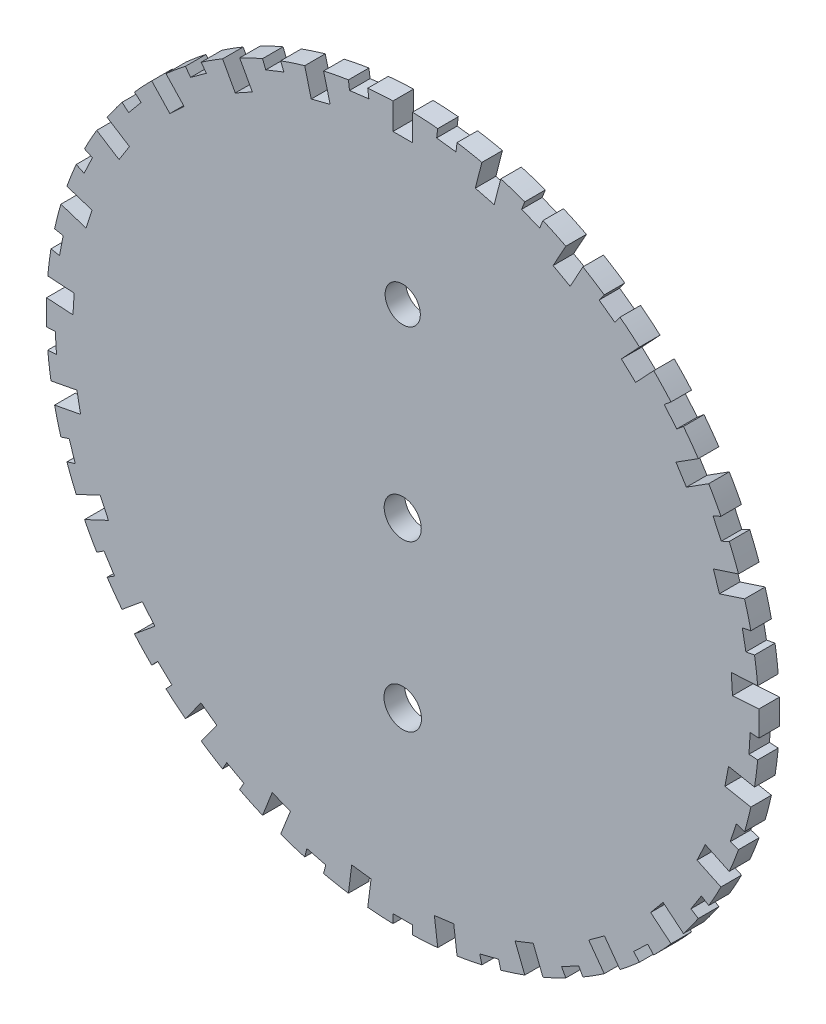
from build123d import *

# Parameters (mm, degrees)
SKETCH1_R           = 2.6873019
SKETCH1_R_2         = 2.658585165
SKETCH1_R_3         = 2.523916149
BOSS_EXTRUDE1_DEPTH = 2.9464


with BuildPart() as part:
    # Sketch1 → Boss-Extrude1 (new body)
    with BuildSketch(Plane.XY):
        with BuildLine():
            Line((13.112954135, 45.454146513), (10.406732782, 46.148986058))
            Line((10.406732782, 46.148986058), (11.349491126, 49.82078738))
            ThreePointArc((11.349491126, 49.82078738), (9.57465676, 50.192108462), (7.787765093, 50.500222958))
            Line((7.787765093, 50.500222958), (7.630985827, 49.259187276))
            Line((7.630985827, 49.259187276), (4.859017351, 49.60936833))
            Line((4.859017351, 49.60936833), (5.015796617, 50.850404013))
            ThreePointArc((5.015796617, 50.850404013), (3.208418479, 50.996351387), (1.397, 51.078079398))
            Line((1.397, 51.078079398), (1.397, 47.28718))
            Line((1.397, 47.28718), (-1.397, 47.28718))
            Line((-1.397, 47.28718), (-1.397, 51.078079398))
            ThreePointArc((-1.397, 51.078079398), (-3.208418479, 50.996351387), (-5.015796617, 50.850404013))
            Line((-5.015796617, 50.850404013), (-4.859017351, 49.60936833))
            Line((-4.859017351, 49.60936833), (-7.630985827, 49.259187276))
            Line((-7.630985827, 49.259187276), (-7.787765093, 50.500222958))
            ThreePointArc((-7.787765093, 50.500222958), (-9.57465676, 50.192108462), (-11.349491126, 49.82078738))
            Line((-11.349491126, 49.82078738), (-10.406732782, 46.148986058))
            Line((-10.406732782, 46.148986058), (-13.112954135, 45.454146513))
            Line((-13.112954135, 45.454146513), (-14.055712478, 49.125947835))
            ThreePointArc((-14.055712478, 49.125947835), (-15.789896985, 48.596306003), (-17.504197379, 48.005467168))
            Line((-17.504197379, 48.005467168), (-17.043710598, 46.842410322))
            Line((-17.043710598, 46.842410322), (-19.6415061, 45.813870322))
            Line((-19.6415061, 45.813870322), (-20.101992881, 46.976927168))
            ThreePointArc((-20.101992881, 46.976927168), (-21.756121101, 46.234110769), (-23.382851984, 45.433072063))
            Line((-23.382851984, 45.433072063), (-21.556572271, 42.111081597))
            Line((-21.556572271, 42.111081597), (-24.004973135, 40.765061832))
            Line((-24.004973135, 40.765061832), (-25.831252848, 44.087052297))
            ThreePointArc((-25.831252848, 44.087052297), (-27.379238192, 43.142775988), (-28.892745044, 42.14417027))
            Line((-28.892745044, 42.14417027), (-28.157484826, 41.132171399))
            Line((-28.157484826, 41.132171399), (-30.417878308, 39.489899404))
            Line((-30.417878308, 39.489899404), (-31.153138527, 40.501898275))
            ThreePointArc((-31.153138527, 40.501898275), (-32.570568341, 39.371053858), (-33.946982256, 38.190629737))
            Line((-33.946982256, 38.190629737), (-31.351933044, 35.427183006))
            Line((-31.351933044, 35.427183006), (-33.388671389, 33.514558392))
            Line((-33.388671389, 33.514558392), (-35.983720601, 36.278005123))
            ThreePointArc((-35.983720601, 36.278005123), (-37.24824117, 34.97842669), (-38.465855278, 33.634800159))
            Line((-38.465855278, 33.634800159), (-37.502020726, 32.837446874))
            Line((-37.502020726, 32.837446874), (-39.282983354, 30.684632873))
            Line((-39.282983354, 30.684632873), (-40.246817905, 31.481986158))
            ThreePointArc((-40.246817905, 31.481986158), (-41.338486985, 30.034168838), (-42.378098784, 28.548529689))
            Line((-42.378098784, 28.548529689), (-39.17733656, 26.517264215))
            Line((-39.17733656, 26.517264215), (-40.674436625, 24.158211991))
            Line((-40.674436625, 24.158211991), (-43.875198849, 26.189477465))
            ThreePointArc((-43.875198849, 26.189477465), (-44.776800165, 24.616254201), (-45.622014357, 23.012031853))
            Line((-45.622014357, 23.012031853), (-44.490166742, 22.479424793))
            Line((-44.490166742, 22.479424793), (-45.679794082, 19.951338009))
            Line((-45.679794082, 19.951338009), (-46.811641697, 20.483945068))
            ThreePointArc((-46.811641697, 20.483945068), (-47.508956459, 18.810126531), (-48.14644351, 17.112620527))
            Line((-48.14644351, 17.112620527), (-44.541083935, 15.941168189))
            Line((-44.541083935, 15.941168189), (-45.404477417, 13.283916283))
            Line((-45.404477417, 13.283916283), (-49.009836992, 14.455368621))
            ThreePointArc((-49.009836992, 14.455368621), (-49.491868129, 12.707351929), (-49.911574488, 10.943332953))
            Line((-49.911574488, 10.943332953), (-48.682831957, 10.70893778))
            Line((-48.682831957, 10.70893778), (-49.20637535, 7.964427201))
            Line((-49.20637535, 7.964427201), (-50.43511788, 8.198822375))
            ThreePointArc((-50.43511788, 8.198822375), (-50.694263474, 6.404174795), (-50.88957012, 4.601462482))
            Line((-50.88957012, 4.601462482), (-47.106151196, 4.363429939))
            Line((-47.106151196, 4.363429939), (-47.281587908, 1.57494326))
            Line((-47.281587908, 1.57494326), (-51.065006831, 1.812975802))
            ThreePointArc((-51.065006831, 1.812975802), (-51.09718, 0), (-51.065006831, -1.812975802))
            Line((-51.065006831, -1.812975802), (-49.816575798, -1.734431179))
            Line((-49.816575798, -1.734431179), (-49.641139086, -4.522917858))
            Line((-49.641139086, -4.522917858), (-50.88957012, -4.601462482))
            ThreePointArc((-50.88957012, -4.601462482), (-50.694263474, -6.404174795), (-50.43511788, -8.198822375))
            Line((-50.43511788, -8.198822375), (-46.711365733, -7.488478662))
            Line((-46.711365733, -7.488478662), (-46.18782234, -10.232989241))
            Line((-46.18782234, -10.232989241), (-49.911574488, -10.943332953))
            ThreePointArc((-49.911574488, -10.943332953), (-49.491868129, -12.707351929), (-49.009836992, -14.455368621))
            Line((-49.009836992, -14.455368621), (-47.820160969, -14.068819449))
            Line((-47.820160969, -14.068819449), (-46.956767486, -16.726071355))
            Line((-46.956767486, -16.726071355), (-48.14644351, -17.112620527))
            ThreePointArc((-48.14644351, -17.112620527), (-47.508956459, -18.810126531), (-46.811641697, -20.483945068))
            Line((-46.811641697, -20.483945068), (-43.381533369, -18.869858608))
            Line((-43.381533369, -18.869858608), (-42.191906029, -21.397945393))
            Line((-42.191906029, -21.397945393), (-45.622014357, -23.012031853))
            ThreePointArc((-45.622014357, -23.012031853), (-44.776800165, -24.616254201), (-43.875198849, -26.189477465))
            Line((-43.875198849, -26.189477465), (-42.819029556, -25.51921205))
            Line((-42.819029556, -25.51921205), (-41.32192949, -27.878264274))
            Line((-41.32192949, -27.878264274), (-42.378098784, -28.548529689))
            ThreePointArc((-42.378098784, -28.548529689), (-41.338486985, -30.034168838), (-40.246817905, -31.481986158))
            Line((-40.246817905, -31.481986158), (-37.325879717, -29.065575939))
            Line((-37.325879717, -29.065575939), (-35.54491709, -31.21838994))
            Line((-35.54491709, -31.21838994), (-38.465855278, -33.634800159))
            ThreePointArc((-38.465855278, -33.634800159), (-37.24824117, -34.97842669), (-35.983720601, -36.278005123))
            Line((-35.983720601, -36.278005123), (-35.127421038, -35.366138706))
            Line((-35.127421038, -35.366138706), (-33.090682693, -37.27876332))
            Line((-33.090682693, -37.27876332), (-33.946982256, -38.190629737))
            ThreePointArc((-33.946982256, -38.190629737), (-32.570568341, -39.371053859), (-31.153138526, -40.501898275))
            Line((-31.153138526, -40.501898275), (-28.924903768, -37.434996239))
            Line((-28.924903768, -37.434996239), (-26.664510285, -39.077268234))
            Line((-26.664510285, -39.077268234), (-28.892745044, -42.14417027))
            ThreePointArc((-28.892745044, -42.14417027), (-27.379238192, -43.142775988), (-25.831252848, -44.087052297))
            Line((-25.831252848, -44.087052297), (-25.228627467, -42.990880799))
            Line((-25.228627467, -42.990880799), (-22.780226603, -44.336900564))
            Line((-22.780226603, -44.336900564), (-23.382851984, -45.433072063))
            ThreePointArc((-23.382851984, -45.433072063), (-21.756121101, -46.234110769), (-20.101992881, -46.976927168))
            Line((-20.101992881, -46.976927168), (-18.706469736, -43.452238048))
            Line((-18.706469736, -43.452238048), (-16.108674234, -44.480778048))
            Line((-16.108674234, -44.480778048), (-17.504197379, -48.005467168))
            ThreePointArc((-17.504197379, -48.005467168), (-15.789896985, -48.596306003), (-14.055712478, -49.125947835))
            Line((-14.055712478, -49.125947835), (-13.744626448, -47.914347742))
            Line((-13.744626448, -47.914347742), (-11.038405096, -48.609187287))
            Line((-11.038405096, -48.609187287), (-11.349491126, -49.82078738))
            ThreePointArc((-11.349491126, -49.82078738), (-9.57465676, -50.192108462), (-7.787765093, -50.500222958))
            Line((-7.787765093, -50.500222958), (-7.312639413, -46.739215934))
            Line((-7.312639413, -46.739215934), (-4.540670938, -47.089396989))
            Line((-4.540670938, -47.089396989), (-5.015796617, -50.850404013))
            ThreePointArc((-5.015796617, -50.850404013), (-3.208418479, -50.996351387), (-1.397, -51.078079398))
            Line((-1.397, -51.078079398), (-1.397, -49.82718))
            Line((-1.397, -49.82718), (1.397, -49.82718))
            Line((1.397, -49.82718), (1.397, -51.078079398))
            ThreePointArc((1.397, -51.078079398), (3.208418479, -50.996351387), (5.015796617, -50.850404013))
            Line((5.015796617, -50.850404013), (4.540670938, -47.089396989))
            Line((4.540670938, -47.089396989), (7.312639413, -46.739215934))
            Line((7.312639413, -46.739215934), (7.787765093, -50.500222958))
            ThreePointArc((7.787765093, -50.500222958), (9.57465676, -50.192108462), (11.349491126, -49.82078738))
            Line((11.349491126, -49.82078738), (11.038405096, -48.609187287))
            Line((11.038405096, -48.609187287), (13.744626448, -47.914347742))
            Line((13.744626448, -47.914347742), (14.055712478, -49.125947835))
            ThreePointArc((14.055712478, -49.125947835), (15.789896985, -48.596306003), (17.504197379, -48.005467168))
            Line((17.504197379, -48.005467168), (16.108674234, -44.480778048))
            Line((16.108674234, -44.480778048), (18.706469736, -43.452238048))
            Line((18.706469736, -43.452238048), (20.101992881, -46.976927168))
            ThreePointArc((20.101992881, -46.976927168), (21.756121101, -46.234110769), (23.382851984, -45.433072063))
            Line((23.382851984, -45.433072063), (22.780226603, -44.336900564))
            Line((22.780226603, -44.336900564), (25.228627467, -42.990880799))
            Line((25.228627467, -42.990880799), (25.831252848, -44.087052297))
            ThreePointArc((25.831252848, -44.087052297), (27.379238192, -43.142775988), (28.892745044, -42.14417027))
            Line((28.892745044, -42.14417027), (26.664510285, -39.077268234))
            Line((26.664510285, -39.077268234), (28.924903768, -37.434996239))
            Line((28.924903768, -37.434996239), (31.153138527, -40.501898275))
            ThreePointArc((31.153138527, -40.501898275), (32.570568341, -39.371053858), (33.946982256, -38.190629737))
            Line((33.946982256, -38.190629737), (33.090682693, -37.27876332))
            Line((33.090682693, -37.27876332), (35.127421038, -35.366138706))
            Line((35.127421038, -35.366138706), (35.983720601, -36.278005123))
            ThreePointArc((35.983720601, -36.278005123), (37.24824117, -34.97842669), (38.465855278, -33.634800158))
            Line((38.465855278, -33.634800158), (35.54491709, -31.21838994))
            Line((35.54491709, -31.21838994), (37.325879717, -29.065575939))
            Line((37.325879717, -29.065575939), (40.246817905, -31.481986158))
            ThreePointArc((40.246817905, -31.481986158), (41.338486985, -30.034168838), (42.378098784, -28.548529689))
            Line((42.378098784, -28.548529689), (41.32192949, -27.878264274))
            Line((41.32192949, -27.878264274), (42.819029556, -25.51921205))
            Line((42.819029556, -25.51921205), (43.875198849, -26.189477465))
            ThreePointArc((43.875198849, -26.189477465), (44.776800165, -24.616254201), (45.622014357, -23.012031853))
            Line((45.622014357, -23.012031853), (42.191906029, -21.397945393))
            Line((42.191906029, -21.397945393), (43.381533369, -18.869858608))
            Line((43.381533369, -18.869858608), (46.811641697, -20.483945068))
            ThreePointArc((46.811641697, -20.483945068), (47.508956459, -18.810126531), (48.14644351, -17.112620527))
            Line((48.14644351, -17.112620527), (46.956767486, -16.726071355))
            Line((46.956767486, -16.726071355), (47.820160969, -14.068819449))
            Line((47.820160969, -14.068819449), (49.009836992, -14.455368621))
            ThreePointArc((49.009836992, -14.455368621), (49.491868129, -12.707351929), (49.911574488, -10.943332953))
            Line((49.911574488, -10.943332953), (46.18782234, -10.232989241))
            Line((46.18782234, -10.232989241), (46.711365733, -7.488478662))
            Line((46.711365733, -7.488478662), (50.43511788, -8.198822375))
            ThreePointArc((50.43511788, -8.198822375), (50.694263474, -6.404174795), (50.88957012, -4.601462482))
            Line((50.88957012, -4.601462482), (49.641139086, -4.522917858))
            Line((49.641139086, -4.522917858), (49.816575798, -1.734431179))
            Line((49.816575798, -1.734431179), (51.065006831, -1.812975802))
            ThreePointArc((51.065006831, -1.812975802), (51.089136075, -0.906630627), (51.09718, 0))
            ThreePointArc((51.09718, 0), (51.089136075, 0.906630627), (51.065006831, 1.812975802))
            Line((51.065006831, 1.812975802), (47.281587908, 1.57494326))
            Line((47.281587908, 1.57494326), (47.106151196, 4.363429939))
            Line((47.106151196, 4.363429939), (50.88957012, 4.601462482))
            ThreePointArc((50.88957012, 4.601462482), (50.694263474, 6.404174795), (50.43511788, 8.198822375))
            Line((50.43511788, 8.198822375), (49.20637535, 7.964427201))
            Line((49.20637535, 7.964427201), (48.682831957, 10.70893778))
            Line((48.682831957, 10.70893778), (49.911574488, 10.943332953))
            ThreePointArc((49.911574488, 10.943332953), (49.491868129, 12.707351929), (49.009836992, 14.455368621))
            Line((49.009836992, 14.455368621), (45.404477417, 13.283916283))
            Line((45.404477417, 13.283916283), (44.541083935, 15.941168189))
            Line((44.541083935, 15.941168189), (48.14644351, 17.112620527))
            ThreePointArc((48.14644351, 17.112620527), (47.508956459, 18.810126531), (46.811641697, 20.483945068))
            Line((46.811641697, 20.483945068), (45.679794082, 19.951338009))
            Line((45.679794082, 19.951338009), (44.490166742, 22.479424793))
            Line((44.490166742, 22.479424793), (45.622014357, 23.012031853))
            ThreePointArc((45.622014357, 23.012031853), (44.776800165, 24.616254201), (43.875198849, 26.189477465))
            Line((43.875198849, 26.189477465), (40.674436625, 24.158211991))
            Line((40.674436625, 24.158211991), (39.17733656, 26.517264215))
            Line((39.17733656, 26.517264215), (42.378098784, 28.548529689))
            ThreePointArc((42.378098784, 28.548529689), (41.338486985, 30.034168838), (40.246817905, 31.481986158))
            Line((40.246817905, 31.481986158), (39.282983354, 30.684632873))
            Line((39.282983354, 30.684632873), (37.502020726, 32.837446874))
            Line((37.502020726, 32.837446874), (38.465855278, 33.634800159))
            ThreePointArc((38.465855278, 33.634800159), (37.24824117, 34.97842669), (35.983720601, 36.278005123))
            Line((35.983720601, 36.278005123), (33.388671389, 33.514558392))
            Line((33.388671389, 33.514558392), (31.351933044, 35.427183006))
            Line((31.351933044, 35.427183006), (33.946982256, 38.190629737))
            ThreePointArc((33.946982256, 38.190629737), (32.570568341, 39.371053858), (31.153138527, 40.501898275))
            Line((31.153138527, 40.501898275), (30.417878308, 39.489899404))
            Line((30.417878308, 39.489899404), (28.157484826, 41.132171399))
            Line((28.157484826, 41.132171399), (28.892745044, 42.14417027))
            ThreePointArc((28.892745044, 42.14417027), (27.379238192, 43.142775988), (25.831252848, 44.087052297))
            Line((25.831252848, 44.087052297), (24.004973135, 40.765061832))
            Line((24.004973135, 40.765061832), (21.556572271, 42.111081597))
            Line((21.556572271, 42.111081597), (23.382851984, 45.433072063))
            ThreePointArc((23.382851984, 45.433072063), (21.756121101, 46.234110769), (20.101992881, 46.976927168))
            Line((20.101992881, 46.976927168), (19.6415061, 45.813870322))
            Line((19.6415061, 45.813870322), (17.043710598, 46.842410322))
            Line((17.043710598, 46.842410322), (17.504197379, 48.005467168))
            ThreePointArc((17.504197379, 48.005467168), (15.789896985, 48.596306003), (14.055712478, 49.125947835))
            Line((14.055712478, 49.125947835), (13.112954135, 45.454146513))
        make_face()
        with Locations((0, -23.591101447)):
            Circle(SKETCH1_R, mode=Mode.SUBTRACT)
        Circle(SKETCH1_R_2, mode=Mode.SUBTRACT)
        with Locations((0, 26.517264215)):
            Circle(SKETCH1_R_3, mode=Mode.SUBTRACT)
    extrude(amount=BOSS_EXTRUDE1_DEPTH)


solid = part.part
